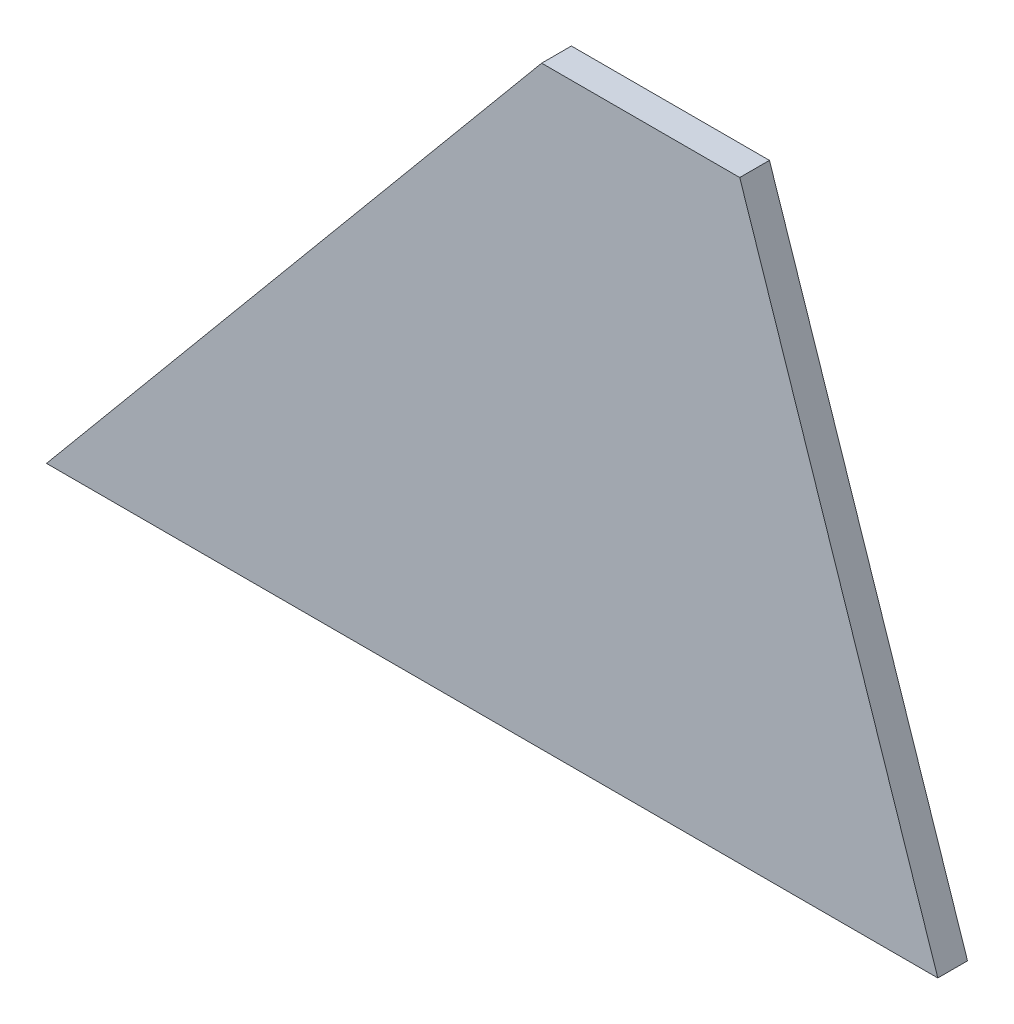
ISO-10303-21;
HEADER;
FILE_DESCRIPTION(('STEP AP214'),'2;1');
FILE_NAME('part.step','',(''),(''),'','','');
FILE_SCHEMA(('AUTOMOTIVE_DESIGN { 1 0 10303 214 1 1 1 1 }'));
ENDSEC;
DATA;
#1=APPLICATION_CONTEXT('core data for automotive mechanical design processes');
#2=APPLICATION_PROTOCOL_DEFINITION('international standard','automotive_design',2000,#1);
#3=PRODUCT_CONTEXT('',#1,'mechanical');
#4=PRODUCT('Part','Part','',(#3));
#5=PRODUCT_RELATED_PRODUCT_CATEGORY('part','',(#4));
#6=PRODUCT_DEFINITION_FORMATION('','',#4);
#7=PRODUCT_DEFINITION_CONTEXT('part definition',#1,'design');
#8=PRODUCT_DEFINITION('design','',#6,#7);
#9=PRODUCT_DEFINITION_SHAPE('','',#8);
#10=(LENGTH_UNIT() NAMED_UNIT(*) SI_UNIT(.MILLI.,.METRE.));
#11=(NAMED_UNIT(*) PLANE_ANGLE_UNIT() SI_UNIT($,.RADIAN.));
#12=(NAMED_UNIT(*) SI_UNIT($,.STERADIAN.) SOLID_ANGLE_UNIT());
#13=UNCERTAINTY_MEASURE_WITH_UNIT(LENGTH_MEASURE(1.E-05),#10,'distance_accuracy_value','');
#14=(GEOMETRIC_REPRESENTATION_CONTEXT(3) GLOBAL_UNCERTAINTY_ASSIGNED_CONTEXT((#13)) GLOBAL_UNIT_ASSIGNED_CONTEXT((#10,
#11,#12)) REPRESENTATION_CONTEXT('',''));
#15=CARTESIAN_POINT('',(0.,0.,0.));
#16=DIRECTION('',(0.,0.,1.));
#17=DIRECTION('',(1.,0.,0.));
#18=AXIS2_PLACEMENT_3D('',#15,#16,#17);
#19=CARTESIAN_POINT('',(81.938515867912,187.354032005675,3.81));
#20=DIRECTION('',(0.,-1.,0.));
#21=DIRECTION('',(0.,0.,-1.));
#22=AXIS2_PLACEMENT_3D('',#19,#20,#21);
#23=PLANE('',#22);
#24=DIRECTION('',(-1.,0.,0.));
#25=VECTOR('',#24,1.);
#26=CARTESIAN_POINT('',(81.938515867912,187.354032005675,0.));
#27=LINE('',#26,#25);
#28=CARTESIAN_POINT('',(107.338515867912,187.354032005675,0.));
#29=VERTEX_POINT('',#28);
#30=CARTESIAN_POINT('',(81.938515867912,187.354032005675,0.));
#31=VERTEX_POINT('',#30);
#32=EDGE_CURVE('E75',#29,#31,#27,.T.);
#33=ORIENTED_EDGE('',*,*,#32,.T.);
#34=DIRECTION('',(0.,0.,-1.));
#35=VECTOR('',#34,1.);
#36=CARTESIAN_POINT('',(81.938515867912,187.354032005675,3.81));
#37=LINE('',#36,#35);
#38=CARTESIAN_POINT('',(81.938515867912,187.354032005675,3.81));
#39=VERTEX_POINT('',#38);
#40=EDGE_CURVE('E11',#39,#31,#37,.T.);
#41=ORIENTED_EDGE('',*,*,#40,.F.);
#42=DIRECTION('',(-1.,0.,0.));
#43=VECTOR('',#42,1.);
#44=CARTESIAN_POINT('',(81.938515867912,187.354032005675,3.81));
#45=LINE('',#44,#43);
#46=CARTESIAN_POINT('',(107.338515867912,187.354032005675,3.81));
#47=VERTEX_POINT('',#46);
#48=EDGE_CURVE('E93',#47,#39,#45,.T.);
#49=ORIENTED_EDGE('',*,*,#48,.F.);
#50=DIRECTION('',(0.,0.,-1.));
#51=VECTOR('',#50,1.);
#52=CARTESIAN_POINT('',(107.338515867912,187.354032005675,3.81));
#53=LINE('',#52,#51);
#54=EDGE_CURVE('E87',#47,#29,#53,.T.);
#55=ORIENTED_EDGE('',*,*,#54,.T.);
#56=EDGE_LOOP('',(#33,#41,#49,#55));
#57=FACE_BOUND('',#56,.T.);
#58=ADVANCED_FACE('F31',(#57),#23,.F.);
#59=CARTESIAN_POINT('',(18.438515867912,111.154032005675,3.81));
#60=DIRECTION('',(0.768221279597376,-0.64018439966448,0.));
#61=DIRECTION('',(0.64018439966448,0.768221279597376,0.));
#62=AXIS2_PLACEMENT_3D('',#59,#60,#61);
#63=PLANE('',#62);
#64=DIRECTION('',(-0.64018439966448,-0.768221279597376,0.));
#65=VECTOR('',#64,1.);
#66=CARTESIAN_POINT('',(18.438515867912,111.154032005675,0.));
#67=LINE('',#66,#65);
#68=CARTESIAN_POINT('',(18.438515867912,111.154032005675,0.));
#69=VERTEX_POINT('',#68);
#70=EDGE_CURVE('E71',#31,#69,#67,.T.);
#71=ORIENTED_EDGE('',*,*,#70,.T.);
#72=DIRECTION('',(0.,0.,-1.));
#73=VECTOR('',#72,1.);
#74=CARTESIAN_POINT('',(18.438515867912,111.154032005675,3.81));
#75=LINE('',#74,#73);
#76=CARTESIAN_POINT('',(18.438515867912,111.154032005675,3.81));
#77=VERTEX_POINT('',#76);
#78=EDGE_CURVE('E38',#77,#69,#75,.T.);
#79=ORIENTED_EDGE('',*,*,#78,.F.);
#80=DIRECTION('',(-0.64018439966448,-0.768221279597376,0.));
#81=VECTOR('',#80,1.);
#82=CARTESIAN_POINT('',(18.438515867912,111.154032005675,3.81));
#83=LINE('',#82,#81);
#84=EDGE_CURVE('E83',#39,#77,#83,.T.);
#85=ORIENTED_EDGE('',*,*,#84,.F.);
#86=ORIENTED_EDGE('',*,*,#40,.T.);
#87=EDGE_LOOP('',(#71,#79,#85,#86));
#88=FACE_BOUND('',#87,.T.);
#89=ADVANCED_FACE('F82',(#88),#63,.F.);
#90=CARTESIAN_POINT('',(107.338515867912,111.154032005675,3.81));
#91=DIRECTION('',(0.,1.,0.));
#92=DIRECTION('',(0.,0.,1.));
#93=AXIS2_PLACEMENT_3D('',#90,#91,#92);
#94=PLANE('',#93);
#95=DIRECTION('',(1.,0.,0.));
#96=VECTOR('',#95,1.);
#97=CARTESIAN_POINT('',(107.338515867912,111.154032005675,0.));
#98=LINE('',#97,#96);
#99=CARTESIAN_POINT('',(132.738515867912,111.154032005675,0.));
#100=VERTEX_POINT('',#99);
#101=EDGE_CURVE('E76',#69,#100,#98,.T.);
#102=ORIENTED_EDGE('',*,*,#101,.T.);
#103=DIRECTION('',(0.,0.,-1.));
#104=VECTOR('',#103,1.);
#105=CARTESIAN_POINT('',(132.738515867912,111.154032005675,3.81));
#106=LINE('',#105,#104);
#107=CARTESIAN_POINT('',(132.738515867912,111.154032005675,3.81));
#108=VERTEX_POINT('',#107);
#109=EDGE_CURVE('E99',#108,#100,#106,.T.);
#110=ORIENTED_EDGE('',*,*,#109,.F.);
#111=DIRECTION('',(1.,0.,0.));
#112=VECTOR('',#111,1.);
#113=CARTESIAN_POINT('',(107.338515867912,111.154032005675,3.81));
#114=LINE('',#113,#112);
#115=EDGE_CURVE('E50',#77,#108,#114,.T.);
#116=ORIENTED_EDGE('',*,*,#115,.F.);
#117=ORIENTED_EDGE('',*,*,#78,.T.);
#118=EDGE_LOOP('',(#102,#110,#116,#117));
#119=FACE_BOUND('',#118,.T.);
#120=ADVANCED_FACE('F102',(#119),#94,.F.);
#121=CARTESIAN_POINT('',(132.738515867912,111.154032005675,3.81));
#122=DIRECTION('',(-0.948683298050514,-0.316227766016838,0.));
#123=DIRECTION('',(0.316227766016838,-0.948683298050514,0.));
#124=AXIS2_PLACEMENT_3D('',#121,#122,#123);
#125=PLANE('',#124);
#126=DIRECTION('',(-0.316227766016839,0.948683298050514,0.));
#127=VECTOR('',#126,1.);
#128=CARTESIAN_POINT('',(132.738515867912,111.154032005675,0.));
#129=LINE('',#128,#127);
#130=EDGE_CURVE('E91',#100,#29,#129,.T.);
#131=ORIENTED_EDGE('',*,*,#130,.T.);
#132=ORIENTED_EDGE('',*,*,#54,.F.);
#133=DIRECTION('',(-0.316227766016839,0.948683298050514,0.));
#134=VECTOR('',#133,1.);
#135=CARTESIAN_POINT('',(132.738515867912,111.154032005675,3.81));
#136=LINE('',#135,#134);
#137=EDGE_CURVE('E45',#108,#47,#136,.T.);
#138=ORIENTED_EDGE('',*,*,#137,.F.);
#139=ORIENTED_EDGE('',*,*,#109,.T.);
#140=EDGE_LOOP('',(#131,#132,#138,#139));
#141=FACE_BOUND('',#140,.T.);
#142=ADVANCED_FACE('F104',(#141),#125,.F.);
#143=CARTESIAN_POINT('',(107.338515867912,187.354032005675,3.81));
#144=DIRECTION('',(0.,0.,1.));
#145=DIRECTION('',(1.,0.,0.));
#146=AXIS2_PLACEMENT_3D('',#143,#144,#145);
#147=PLANE('',#146);
#148=ORIENTED_EDGE('',*,*,#48,.T.);
#149=ORIENTED_EDGE('',*,*,#84,.T.);
#150=ORIENTED_EDGE('',*,*,#115,.T.);
#151=ORIENTED_EDGE('',*,*,#137,.T.);
#152=EDGE_LOOP('',(#148,#149,#150,#151));
#153=FACE_BOUND('',#152,.T.);
#154=ADVANCED_FACE('F105',(#153),#147,.T.);
#155=CARTESIAN_POINT('',(107.338515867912,187.354032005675,0.));
#156=DIRECTION('',(0.,0.,1.));
#157=DIRECTION('',(1.,0.,0.));
#158=AXIS2_PLACEMENT_3D('',#155,#156,#157);
#159=PLANE('',#158);
#160=ORIENTED_EDGE('',*,*,#32,.F.);
#161=ORIENTED_EDGE('',*,*,#130,.F.);
#162=ORIENTED_EDGE('',*,*,#101,.F.);
#163=ORIENTED_EDGE('',*,*,#70,.F.);
#164=EDGE_LOOP('',(#160,#161,#162,#163));
#165=FACE_BOUND('',#164,.T.);
#166=ADVANCED_FACE('F72',(#165),#159,.F.);
#167=CLOSED_SHELL('',(#58,#89,#120,#142,#154,#166));
#168=MANIFOLD_SOLID_BREP('B2',#167);
#169=ADVANCED_BREP_SHAPE_REPRESENTATION('',(#18,#168),#14);
#170=SHAPE_DEFINITION_REPRESENTATION(#9,#169);
ENDSEC;
END-ISO-10303-21;
